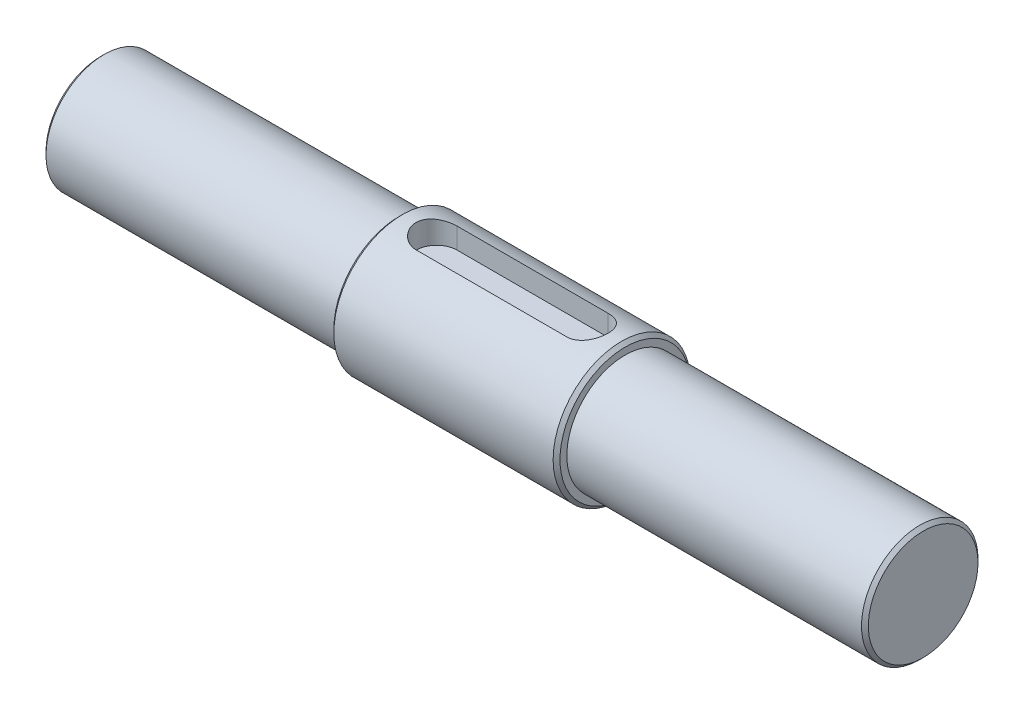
ISO-10303-21;
HEADER;
FILE_DESCRIPTION(('STEP AP214'),'2;1');
FILE_NAME('part.step','',(''),(''),'','','');
FILE_SCHEMA(('AUTOMOTIVE_DESIGN { 1 0 10303 214 1 1 1 1 }'));
ENDSEC;
DATA;
#1=APPLICATION_CONTEXT('core data for automotive mechanical design processes');
#2=APPLICATION_PROTOCOL_DEFINITION('international standard','automotive_design',2000,#1);
#3=PRODUCT_CONTEXT('',#1,'mechanical');
#4=PRODUCT('Part','Part','',(#3));
#5=PRODUCT_RELATED_PRODUCT_CATEGORY('part','',(#4));
#6=PRODUCT_DEFINITION_FORMATION('','',#4);
#7=PRODUCT_DEFINITION_CONTEXT('part definition',#1,'design');
#8=PRODUCT_DEFINITION('design','',#6,#7);
#9=PRODUCT_DEFINITION_SHAPE('','',#8);
#10=(LENGTH_UNIT() NAMED_UNIT(*) SI_UNIT(.MILLI.,.METRE.));
#11=(NAMED_UNIT(*) PLANE_ANGLE_UNIT() SI_UNIT($,.RADIAN.));
#12=(NAMED_UNIT(*) SI_UNIT($,.STERADIAN.) SOLID_ANGLE_UNIT());
#13=UNCERTAINTY_MEASURE_WITH_UNIT(LENGTH_MEASURE(1.E-05),#10,'distance_accuracy_value','');
#14=(GEOMETRIC_REPRESENTATION_CONTEXT(3) GLOBAL_UNCERTAINTY_ASSIGNED_CONTEXT((#13)) GLOBAL_UNIT_ASSIGNED_CONTEXT((#10,
#11,#12)) REPRESENTATION_CONTEXT('',''));
#15=CARTESIAN_POINT('',(0.,0.,0.));
#16=DIRECTION('',(0.,0.,1.));
#17=DIRECTION('',(1.,0.,0.));
#18=AXIS2_PLACEMENT_3D('',#15,#16,#17);
#19=CARTESIAN_POINT('',(78.5,0.,0.));
#20=DIRECTION('',(-1.,0.,0.));
#21=DIRECTION('',(0.,0.,1.));
#22=AXIS2_PLACEMENT_3D('',#19,#20,#21);
#23=CYLINDRICAL_SURFACE('',#22,10.);
#24=CARTESIAN_POINT('',(46.,0.,0.));
#25=DIRECTION('',(-1.,0.,0.));
#26=DIRECTION('',(0.,0.,1.));
#27=AXIS2_PLACEMENT_3D('',#24,#25,#26);
#28=CIRCLE('',#27,10.);
#29=CARTESIAN_POINT('',(46.,0.,10.));
#30=VERTEX_POINT('',#29);
#31=EDGE_CURVE('E177',#30,#30,#28,.F.);
#32=ORIENTED_EDGE('',*,*,#31,.T.);
#33=EDGE_LOOP('',(#32));
#34=FACE_BOUND('',#33,.T.);
#35=CARTESIAN_POINT('',(78.,0.,0.));
#36=DIRECTION('',(1.,0.,0.));
#37=DIRECTION('',(0.,0.,-1.));
#38=AXIS2_PLACEMENT_3D('',#35,#36,#37);
#39=CIRCLE('',#38,10.);
#40=CARTESIAN_POINT('',(78.,0.,-10.));
#41=VERTEX_POINT('',#40);
#42=EDGE_CURVE('E180',#41,#41,#39,.F.);
#43=ORIENTED_EDGE('',*,*,#42,.T.);
#44=EDGE_LOOP('',(#43));
#45=FACE_BOUND('',#44,.T.);
#46=CARTESIAN_POINT('',(73.,9.53939201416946,3.));
#47=CARTESIAN_POINT('',(73.0823355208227,9.53938054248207,3.00001027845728));
#48=CARTESIAN_POINT('',(73.1646644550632,9.54045772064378,2.99661062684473));
#49=CARTESIAN_POINT('',(73.3286939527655,9.54470412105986,2.98307142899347));
#50=CARTESIAN_POINT('',(73.4103946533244,9.54787287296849,2.97293339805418));
#51=CARTESIAN_POINT('',(73.5723849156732,9.55620668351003,2.94603140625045));
#52=CARTESIAN_POINT('',(73.652677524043,9.56136667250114,2.92928426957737));
#53=CARTESIAN_POINT('',(73.8114758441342,9.57351626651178,2.88932853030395));
#54=CARTESIAN_POINT('',(73.8899815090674,9.58050591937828,2.86611975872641));
#55=CARTESIAN_POINT('',(74.1219493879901,9.60391637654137,2.78708584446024));
#56=CARTESIAN_POINT('',(74.272068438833,9.62279007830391,2.72181852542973));
#57=CARTESIAN_POINT('',(74.559226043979,9.66493213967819,2.56815043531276));
#58=CARTESIAN_POINT('',(74.6962584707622,9.6882025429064,2.47973889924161));
#59=CARTESIAN_POINT('',(74.9577229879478,9.73733650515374,2.27929879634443));
#60=CARTESIAN_POINT('',(75.0816848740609,9.76325505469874,2.16666914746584));
#61=CARTESIAN_POINT('',(75.3092736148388,9.81429628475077,1.92227736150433));
#62=CARTESIAN_POINT('',(75.412897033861,9.8394188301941,1.79051199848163));
#63=CARTESIAN_POINT('',(75.5989268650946,9.88666477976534,1.50821997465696));
#64=CARTESIAN_POINT('',(75.6808501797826,9.90871541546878,1.35736167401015));
#65=CARTESIAN_POINT('',(75.8179770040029,9.94668940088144,1.04324233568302));
#66=CARTESIAN_POINT('',(75.873187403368,9.96261433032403,0.879984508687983));
#67=CARTESIAN_POINT('',(75.953759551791,9.98615279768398,0.5506494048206));
#68=CARTESIAN_POINT('',(75.9799297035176,9.99399098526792,0.3847862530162));
#69=CARTESIAN_POINT('',(76.004234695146,10.0012640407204,0.0508471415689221));
#70=CARTESIAN_POINT('',(76.0023748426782,10.0007004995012,-0.117228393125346));
#71=CARTESIAN_POINT('',(75.9712141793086,9.99139205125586,-0.445143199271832));
#72=CARTESIAN_POINT('',(75.9427893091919,9.98290831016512,-0.605074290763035));
#73=CARTESIAN_POINT('',(75.8607367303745,9.95903027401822,-0.91778010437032));
#74=CARTESIAN_POINT('',(75.8071077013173,9.94363561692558,-1.07055445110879));
#75=CARTESIAN_POINT('',(75.6755755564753,9.90730429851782,-1.36669563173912));
#76=CARTESIAN_POINT('',(75.5973967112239,9.88630511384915,-1.50993201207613));
#77=CARTESIAN_POINT('',(75.4192028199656,9.84099249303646,-1.78153105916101));
#78=CARTESIAN_POINT('',(75.3191828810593,9.81667831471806,-1.90989038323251));
#79=CARTESIAN_POINT('',(75.0956160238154,9.7662334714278,-2.15330901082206));
#80=CARTESIAN_POINT('',(74.9713122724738,9.74006890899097,-2.26766702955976));
#81=CARTESIAN_POINT('',(74.7050051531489,9.68968430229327,-2.47413538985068));
#82=CARTESIAN_POINT('',(74.5629966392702,9.66546482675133,-2.56623924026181));
#83=CARTESIAN_POINT('',(74.2634381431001,9.62154457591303,-2.72632814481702));
#84=CARTESIAN_POINT('',(74.1057456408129,9.60189192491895,-2.79406012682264));
#85=CARTESIAN_POINT('',(73.7805509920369,9.56991327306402,-2.90171772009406));
#86=CARTESIAN_POINT('',(73.6130642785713,9.55757606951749,-2.94168586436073));
#87=CARTESIAN_POINT('',(73.3700102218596,9.54628064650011,-2.9780240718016));
#88=CARTESIAN_POINT('',(73.2962185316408,9.54370312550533,-2.98626405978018));
#89=CARTESIAN_POINT('',(73.148297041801,9.54025857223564,-2.99724711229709));
#90=CARTESIAN_POINT('',(73.0741679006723,9.53938902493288,-2.99999825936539));
#91=CARTESIAN_POINT('',(73.,9.53939201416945,-3.00000000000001));
#92=B_SPLINE_CURVE_WITH_KNOTS('',3,(#46,#47,#48,#49,#50,#51,#52,#53,#54,#55,#56,#57,#58,#59,#60,
#61,#62,#63,#64,#65,#66,#67,#68,#69,#70,#71,#72,#73,#74,#75,#76,#77,#78,#79,#80,#81,#82,#83,#84,
#85,#86,#87,#88,#89,#90,#91),.UNSPECIFIED.,.F.,.F.,(4,2,2,2,2,2,2,2,2,2,2,2,2,2,2,2,2,2,2,2,2,2,
4),(0.,0.246918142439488,0.493780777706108,0.740019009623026,0.986263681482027,1.47813347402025,
1.97023245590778,2.47635119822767,2.98255536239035,3.49922810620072,4.01576751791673,
4.51753600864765,5.01920948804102,5.50490358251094,5.99062312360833,6.48200583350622,
6.97349873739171,7.48389234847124,7.99443465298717,8.51013494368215,9.02504345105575,
9.24774267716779,9.47011372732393),.UNSPECIFIED.);
#93=CARTESIAN_POINT('',(73.,9.53939201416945,3.00000000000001));
#94=VERTEX_POINT('',#93);
#95=CARTESIAN_POINT('',(73.,9.53939201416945,-3.00000000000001));
#96=VERTEX_POINT('',#95);
#97=EDGE_CURVE('E109',#94,#96,#92,.T.);
#98=ORIENTED_EDGE('',*,*,#97,.F.);
#99=DIRECTION('',(-1.,0.,0.));
#100=VECTOR('',#99,1.);
#101=CARTESIAN_POINT('',(61.,9.53939201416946,3.));
#102=LINE('',#101,#100);
#103=CARTESIAN_POINT('',(51.,9.53939201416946,3.));
#104=VERTEX_POINT('',#103);
#105=EDGE_CURVE('E62',#104,#94,#102,.F.);
#106=ORIENTED_EDGE('',*,*,#105,.F.);
#107=CARTESIAN_POINT('',(51.,9.53939201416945,-3.00000000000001));
#108=CARTESIAN_POINT('',(50.9176644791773,9.53938054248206,-3.00001027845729));
#109=CARTESIAN_POINT('',(50.8353355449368,9.54045772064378,-2.99661062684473));
#110=CARTESIAN_POINT('',(50.6713060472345,9.54470412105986,-2.98307142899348));
#111=CARTESIAN_POINT('',(50.5896053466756,9.54787287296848,-2.97293339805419));
#112=CARTESIAN_POINT('',(50.4276150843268,9.55620668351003,-2.94603140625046));
#113=CARTESIAN_POINT('',(50.347322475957,9.56136667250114,-2.92928426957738));
#114=CARTESIAN_POINT('',(50.1885241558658,9.57351626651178,-2.88932853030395));
#115=CARTESIAN_POINT('',(50.1100184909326,9.58050591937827,-2.86611975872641));
#116=CARTESIAN_POINT('',(49.8780506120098,9.60391637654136,-2.78708584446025));
#117=CARTESIAN_POINT('',(49.727931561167,9.62279007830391,-2.72181852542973));
#118=CARTESIAN_POINT('',(49.4407739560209,9.66493213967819,-2.56815043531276));
#119=CARTESIAN_POINT('',(49.3037415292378,9.68820254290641,-2.4797388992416));
#120=CARTESIAN_POINT('',(49.0422770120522,9.73733650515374,-2.27929879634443));
#121=CARTESIAN_POINT('',(48.9183151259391,9.76325505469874,-2.16666914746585));
#122=CARTESIAN_POINT('',(48.6907263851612,9.81429628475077,-1.92227736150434));
#123=CARTESIAN_POINT('',(48.587102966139,9.8394188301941,-1.79051199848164));
#124=CARTESIAN_POINT('',(48.4010731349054,9.88666477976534,-1.50821997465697));
#125=CARTESIAN_POINT('',(48.3191498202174,9.90871541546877,-1.35736167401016));
#126=CARTESIAN_POINT('',(48.1820229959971,9.94668940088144,-1.04324233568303));
#127=CARTESIAN_POINT('',(48.126812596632,9.96261433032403,-0.879984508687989));
#128=CARTESIAN_POINT('',(48.046240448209,9.98615279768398,-0.550649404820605));
#129=CARTESIAN_POINT('',(48.0200702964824,9.99399098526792,-0.384786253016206));
#130=CARTESIAN_POINT('',(47.9957653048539,10.0012640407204,-0.0508471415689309));
#131=CARTESIAN_POINT('',(47.9976251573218,10.0007004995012,0.117228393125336));
#132=CARTESIAN_POINT('',(48.0287858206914,9.99139205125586,0.445143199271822));
#133=CARTESIAN_POINT('',(48.0572106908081,9.98290831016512,0.605074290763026));
#134=CARTESIAN_POINT('',(48.1392632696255,9.95903027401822,0.917780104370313));
#135=CARTESIAN_POINT('',(48.1928922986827,9.94363561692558,1.07055445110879));
#136=CARTESIAN_POINT('',(48.3244244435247,9.90730429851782,1.36669563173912));
#137=CARTESIAN_POINT('',(48.4026032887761,9.88630511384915,1.50993201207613));
#138=CARTESIAN_POINT('',(48.5807971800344,9.84099249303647,1.781531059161));
#139=CARTESIAN_POINT('',(48.6808171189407,9.81667831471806,1.90989038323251));
#140=CARTESIAN_POINT('',(48.9043839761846,9.7662334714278,2.15330901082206));
#141=CARTESIAN_POINT('',(49.0286877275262,9.74006890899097,2.26766702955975));
#142=CARTESIAN_POINT('',(49.2949948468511,9.68968430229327,2.47413538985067));
#143=CARTESIAN_POINT('',(49.4370033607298,9.66546482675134,2.5662392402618));
#144=CARTESIAN_POINT('',(49.7365618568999,9.62154457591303,2.72632814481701));
#145=CARTESIAN_POINT('',(49.8942543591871,9.60189192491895,2.79406012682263));
#146=CARTESIAN_POINT('',(50.2194490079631,9.56991327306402,2.90171772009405));
#147=CARTESIAN_POINT('',(50.3869357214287,9.55757606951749,2.94168586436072));
#148=CARTESIAN_POINT('',(50.6299897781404,9.54628064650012,2.97802407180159));
#149=CARTESIAN_POINT('',(50.7037814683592,9.54370312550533,2.98626405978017));
#150=CARTESIAN_POINT('',(50.8517029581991,9.54025857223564,2.99724711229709));
#151=CARTESIAN_POINT('',(50.9258320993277,9.53938902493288,2.99999825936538));
#152=CARTESIAN_POINT('',(51.,9.53939201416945,3.));
#153=B_SPLINE_CURVE_WITH_KNOTS('',3,(#107,#108,#109,#110,#111,#112,#113,#114,#115,#116,#117,
#118,#119,#120,#121,#122,#123,#124,#125,#126,#127,#128,#129,#130,#131,#132,#133,#134,#135,#136,
#137,#138,#139,#140,#141,#142,#143,#144,#145,#146,#147,#148,#149,#150,#151,#152),.UNSPECIFIED.,
.F.,.F.,(4,2,2,2,2,2,2,2,2,2,2,2,2,2,2,2,2,2,2,2,2,2,4),(0.,0.246918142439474,0.493780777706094,
0.74001900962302,0.986263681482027,1.47813347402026,1.97023245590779,2.47635119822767,
2.98255536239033,3.49922810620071,4.01576751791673,4.51753600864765,5.01920948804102,
5.50490358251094,5.99062312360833,6.48200583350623,6.97349873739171,7.48389234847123,
7.99443465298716,8.51013494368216,9.02504345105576,9.24774267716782,9.47011372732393),.UNSPECIFIED.);
#154=CARTESIAN_POINT('',(51.,9.53939201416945,-3.00000000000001));
#155=VERTEX_POINT('',#154);
#156=EDGE_CURVE('E106',#155,#104,#153,.T.);
#157=ORIENTED_EDGE('',*,*,#156,.F.);
#158=DIRECTION('',(-1.,0.,0.));
#159=VECTOR('',#158,1.);
#160=CARTESIAN_POINT('',(61.,9.53939201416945,-3.00000000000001));
#161=LINE('',#160,#159);
#162=EDGE_CURVE('E117',#96,#155,#161,.T.);
#163=ORIENTED_EDGE('',*,*,#162,.F.);
#164=EDGE_LOOP('',(#98,#106,#157,#163));
#165=FACE_BOUND('',#164,.T.);
#166=ADVANCED_FACE('F41',(#34,#45,#165),#23,.T.);
#167=CARTESIAN_POINT('',(78.5,10.,0.));
#168=DIRECTION('',(1.,0.,0.));
#169=DIRECTION('',(0.,0.,-1.));
#170=AXIS2_PLACEMENT_3D('',#167,#168,#169);
#171=PLANE('',#170);
#172=CARTESIAN_POINT('',(78.5,0.,0.));
#173=DIRECTION('',(1.,0.,0.));
#174=DIRECTION('',(0.,0.,-1.));
#175=AXIS2_PLACEMENT_3D('',#172,#173,#174);
#176=CIRCLE('',#175,9.50000000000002);
#177=CARTESIAN_POINT('',(78.5,0.,-9.50000000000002));
#178=VERTEX_POINT('',#177);
#179=EDGE_CURVE('E11',#178,#178,#176,.T.);
#180=ORIENTED_EDGE('',*,*,#179,.T.);
#181=EDGE_LOOP('',(#180));
#182=FACE_BOUND('',#181,.T.);
#183=CARTESIAN_POINT('',(78.5,0.,0.));
#184=DIRECTION('',(1.,0.,0.));
#185=DIRECTION('',(0.,0.,-1.));
#186=AXIS2_PLACEMENT_3D('',#183,#184,#185);
#187=CIRCLE('',#186,8.5);
#188=CARTESIAN_POINT('',(78.5,0.,-8.5));
#189=VERTEX_POINT('',#188);
#190=EDGE_CURVE('E105',#189,#189,#187,.T.);
#191=ORIENTED_EDGE('',*,*,#190,.F.);
#192=EDGE_LOOP('',(#191));
#193=FACE_BOUND('',#192,.T.);
#194=ADVANCED_FACE('F149',(#182,#193),#171,.T.);
#195=CARTESIAN_POINT('',(45.5,0.,0.));
#196=DIRECTION('',(-1.,0.,0.));
#197=DIRECTION('',(0.,0.,1.));
#198=AXIS2_PLACEMENT_3D('',#195,#196,#197);
#199=PLANE('',#198);
#200=CARTESIAN_POINT('',(45.5,0.,0.));
#201=DIRECTION('',(-1.,0.,0.));
#202=DIRECTION('',(0.,0.,1.));
#203=AXIS2_PLACEMENT_3D('',#200,#201,#202);
#204=CIRCLE('',#203,9.49999999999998);
#205=CARTESIAN_POINT('',(45.5,0.,9.49999999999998));
#206=VERTEX_POINT('',#205);
#207=EDGE_CURVE('E185',#206,#206,#204,.T.);
#208=ORIENTED_EDGE('',*,*,#207,.T.);
#209=EDGE_LOOP('',(#208));
#210=FACE_BOUND('',#209,.T.);
#211=CARTESIAN_POINT('',(45.5,0.,0.));
#212=DIRECTION('',(-1.,0.,0.));
#213=DIRECTION('',(0.,0.,1.));
#214=AXIS2_PLACEMENT_3D('',#211,#212,#213);
#215=CIRCLE('',#214,8.5);
#216=CARTESIAN_POINT('',(45.5,0.,8.5));
#217=VERTEX_POINT('',#216);
#218=EDGE_CURVE('E194',#217,#217,#215,.T.);
#219=ORIENTED_EDGE('',*,*,#218,.F.);
#220=EDGE_LOOP('',(#219));
#221=FACE_BOUND('',#220,.T.);
#222=ADVANCED_FACE('F145',(#210,#221),#199,.T.);
#223=CARTESIAN_POINT('',(122.,0.,0.));
#224=DIRECTION('',(-1.,0.,0.));
#225=DIRECTION('',(0.,0.,1.));
#226=AXIS2_PLACEMENT_3D('',#223,#224,#225);
#227=CYLINDRICAL_SURFACE('',#226,8.5);
#228=CARTESIAN_POINT('',(121.5,0.,0.));
#229=DIRECTION('',(1.,0.,0.));
#230=DIRECTION('',(0.,0.,-1.));
#231=AXIS2_PLACEMENT_3D('',#228,#229,#230);
#232=CIRCLE('',#231,8.5);
#233=CARTESIAN_POINT('',(121.5,0.,-8.5));
#234=VERTEX_POINT('',#233);
#235=EDGE_CURVE('E49',#234,#234,#232,.F.);
#236=ORIENTED_EDGE('',*,*,#235,.T.);
#237=EDGE_LOOP('',(#236));
#238=FACE_BOUND('',#237,.T.);
#239=ORIENTED_EDGE('',*,*,#190,.T.);
#240=EDGE_LOOP('',(#239));
#241=FACE_BOUND('',#240,.T.);
#242=ADVANCED_FACE('F141',(#238,#241),#227,.T.);
#243=CARTESIAN_POINT('',(122.,0.,0.));
#244=DIRECTION('',(1.,0.,0.));
#245=DIRECTION('',(0.,0.,-1.));
#246=AXIS2_PLACEMENT_3D('',#243,#244,#245);
#247=PLANE('',#246);
#248=CARTESIAN_POINT('',(122.,0.,0.));
#249=DIRECTION('',(1.,0.,0.));
#250=DIRECTION('',(0.,0.,-1.));
#251=AXIS2_PLACEMENT_3D('',#248,#249,#250);
#252=CIRCLE('',#251,7.99999999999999);
#253=CARTESIAN_POINT('',(122.,0.,-7.99999999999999));
#254=VERTEX_POINT('',#253);
#255=EDGE_CURVE('E176',#254,#254,#252,.T.);
#256=ORIENTED_EDGE('',*,*,#255,.T.);
#257=EDGE_LOOP('',(#256));
#258=FACE_BOUND('',#257,.T.);
#259=ADVANCED_FACE('F137',(#258),#247,.T.);
#260=CARTESIAN_POINT('',(1.99999999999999,0.,0.));
#261=DIRECTION('',(1.,0.,0.));
#262=DIRECTION('',(0.,0.,-1.));
#263=AXIS2_PLACEMENT_3D('',#260,#261,#262);
#264=CYLINDRICAL_SURFACE('',#263,8.5);
#265=CARTESIAN_POINT('',(2.50000000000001,0.,0.));
#266=DIRECTION('',(-1.,0.,0.));
#267=DIRECTION('',(0.,0.,1.));
#268=AXIS2_PLACEMENT_3D('',#265,#266,#267);
#269=CIRCLE('',#268,8.5);
#270=CARTESIAN_POINT('',(2.50000000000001,0.,8.5));
#271=VERTEX_POINT('',#270);
#272=EDGE_CURVE('E188',#271,#271,#269,.F.);
#273=ORIENTED_EDGE('',*,*,#272,.T.);
#274=EDGE_LOOP('',(#273));
#275=FACE_BOUND('',#274,.T.);
#276=ORIENTED_EDGE('',*,*,#218,.T.);
#277=EDGE_LOOP('',(#276));
#278=FACE_BOUND('',#277,.T.);
#279=ADVANCED_FACE('F133',(#275,#278),#264,.T.);
#280=CARTESIAN_POINT('',(1.99999999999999,0.,0.));
#281=DIRECTION('',(-1.,0.,0.));
#282=DIRECTION('',(0.,0.,1.));
#283=AXIS2_PLACEMENT_3D('',#280,#281,#282);
#284=PLANE('',#283);
#285=CARTESIAN_POINT('',(1.99999999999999,0.,0.));
#286=DIRECTION('',(-1.,0.,0.));
#287=DIRECTION('',(0.,0.,1.));
#288=AXIS2_PLACEMENT_3D('',#285,#286,#287);
#289=CIRCLE('',#288,7.99999999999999);
#290=CARTESIAN_POINT('',(1.99999999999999,0.,7.99999999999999));
#291=VERTEX_POINT('',#290);
#292=EDGE_CURVE('E191',#291,#291,#289,.T.);
#293=ORIENTED_EDGE('',*,*,#292,.T.);
#294=EDGE_LOOP('',(#293));
#295=FACE_BOUND('',#294,.T.);
#296=ADVANCED_FACE('F129',(#295),#284,.T.);
#297=CARTESIAN_POINT('',(73.,10.001,0.));
#298=DIRECTION('',(0.,-1.,0.));
#299=DIRECTION('',(0.,0.,-1.));
#300=AXIS2_PLACEMENT_3D('',#297,#298,#299);
#301=CYLINDRICAL_SURFACE('',#300,3.00000000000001);
#302=ORIENTED_EDGE('',*,*,#97,.T.);
#303=DIRECTION('',(0.,-1.,0.));
#304=VECTOR('',#303,1.);
#305=CARTESIAN_POINT('',(73.,10.001,-3.00000000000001));
#306=LINE('',#305,#304);
#307=CARTESIAN_POINT('',(73.,6.50000000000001,-3.00000000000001));
#308=VERTEX_POINT('',#307);
#309=EDGE_CURVE('E85',#96,#308,#306,.T.);
#310=ORIENTED_EDGE('',*,*,#309,.T.);
#311=CARTESIAN_POINT('',(73.,6.50000000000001,0.));
#312=DIRECTION('',(0.,-1.,0.));
#313=DIRECTION('',(0.,0.,-1.));
#314=AXIS2_PLACEMENT_3D('',#311,#312,#313);
#315=CIRCLE('',#314,3.00000000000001);
#316=CARTESIAN_POINT('',(73.,6.50000000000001,3.00000000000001));
#317=VERTEX_POINT('',#316);
#318=EDGE_CURVE('E92',#308,#317,#315,.T.);
#319=ORIENTED_EDGE('',*,*,#318,.T.);
#320=DIRECTION('',(0.,-1.,0.));
#321=VECTOR('',#320,1.);
#322=CARTESIAN_POINT('',(73.,10.001,3.));
#323=LINE('',#322,#321);
#324=EDGE_CURVE('E77',#94,#317,#323,.T.);
#325=ORIENTED_EDGE('',*,*,#324,.F.);
#326=EDGE_LOOP('',(#302,#310,#319,#325));
#327=FACE_BOUND('',#326,.T.);
#328=ADVANCED_FACE('F97',(#327),#301,.F.);
#329=CARTESIAN_POINT('',(51.,10.001,-3.00000000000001));
#330=DIRECTION('',(0.,0.,-1.));
#331=DIRECTION('',(0.,1.,0.));
#332=AXIS2_PLACEMENT_3D('',#329,#330,#331);
#333=PLANE('',#332);
#334=ORIENTED_EDGE('',*,*,#162,.T.);
#335=DIRECTION('',(0.,-1.,0.));
#336=VECTOR('',#335,1.);
#337=CARTESIAN_POINT('',(51.,10.001,-3.00000000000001));
#338=LINE('',#337,#336);
#339=CARTESIAN_POINT('',(51.,6.50000000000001,-3.00000000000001));
#340=VERTEX_POINT('',#339);
#341=EDGE_CURVE('E100',#155,#340,#338,.T.);
#342=ORIENTED_EDGE('',*,*,#341,.T.);
#343=DIRECTION('',(1.,0.,0.));
#344=VECTOR('',#343,1.);
#345=CARTESIAN_POINT('',(51.,6.50000000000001,-3.00000000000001));
#346=LINE('',#345,#344);
#347=EDGE_CURVE('E118',#340,#308,#346,.T.);
#348=ORIENTED_EDGE('',*,*,#347,.T.);
#349=ORIENTED_EDGE('',*,*,#309,.F.);
#350=EDGE_LOOP('',(#334,#342,#348,#349));
#351=FACE_BOUND('',#350,.T.);
#352=ADVANCED_FACE('F215',(#351),#333,.F.);
#353=CARTESIAN_POINT('',(51.,10.001,0.));
#354=DIRECTION('',(0.,-1.,0.));
#355=DIRECTION('',(0.,0.,-1.));
#356=AXIS2_PLACEMENT_3D('',#353,#354,#355);
#357=CYLINDRICAL_SURFACE('',#356,3.00000000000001);
#358=ORIENTED_EDGE('',*,*,#156,.T.);
#359=DIRECTION('',(0.,-1.,0.));
#360=VECTOR('',#359,1.);
#361=CARTESIAN_POINT('',(51.,10.001,3.));
#362=LINE('',#361,#360);
#363=CARTESIAN_POINT('',(51.,6.50000000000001,3.));
#364=VERTEX_POINT('',#363);
#365=EDGE_CURVE('E56',#104,#364,#362,.T.);
#366=ORIENTED_EDGE('',*,*,#365,.T.);
#367=CARTESIAN_POINT('',(51.,6.50000000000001,0.));
#368=DIRECTION('',(0.,-1.,0.));
#369=DIRECTION('',(0.,0.,-1.));
#370=AXIS2_PLACEMENT_3D('',#367,#368,#369);
#371=CIRCLE('',#370,3.00000000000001);
#372=EDGE_CURVE('E95',#364,#340,#371,.T.);
#373=ORIENTED_EDGE('',*,*,#372,.T.);
#374=ORIENTED_EDGE('',*,*,#341,.F.);
#375=EDGE_LOOP('',(#358,#366,#373,#374));
#376=FACE_BOUND('',#375,.T.);
#377=ADVANCED_FACE('F220',(#376),#357,.F.);
#378=CARTESIAN_POINT('',(73.,10.001,3.));
#379=DIRECTION('',(0.,0.,1.));
#380=DIRECTION('',(0.,-1.,0.));
#381=AXIS2_PLACEMENT_3D('',#378,#379,#380);
#382=PLANE('',#381);
#383=ORIENTED_EDGE('',*,*,#105,.T.);
#384=ORIENTED_EDGE('',*,*,#324,.T.);
#385=DIRECTION('',(-1.,0.,0.));
#386=VECTOR('',#385,1.);
#387=CARTESIAN_POINT('',(73.,6.50000000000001,3.00000000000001));
#388=LINE('',#387,#386);
#389=EDGE_CURVE('E80',#317,#364,#388,.T.);
#390=ORIENTED_EDGE('',*,*,#389,.T.);
#391=ORIENTED_EDGE('',*,*,#365,.F.);
#392=EDGE_LOOP('',(#383,#384,#390,#391));
#393=FACE_BOUND('',#392,.T.);
#394=ADVANCED_FACE('F79',(#393),#382,.F.);
#395=CARTESIAN_POINT('',(73.,6.50000000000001,0.));
#396=DIRECTION('',(0.,-1.,0.));
#397=DIRECTION('',(0.,0.,-1.));
#398=AXIS2_PLACEMENT_3D('',#395,#396,#397);
#399=PLANE('',#398);
#400=ORIENTED_EDGE('',*,*,#318,.F.);
#401=ORIENTED_EDGE('',*,*,#347,.F.);
#402=ORIENTED_EDGE('',*,*,#372,.F.);
#403=ORIENTED_EDGE('',*,*,#389,.F.);
#404=EDGE_LOOP('',(#400,#401,#402,#403));
#405=FACE_BOUND('',#404,.T.);
#406=ADVANCED_FACE('F90',(#405),#399,.F.);
#407=CARTESIAN_POINT('',(1.99999999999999,0.,0.));
#408=DIRECTION('',(1.,0.,0.));
#409=DIRECTION('',(0.,0.,-1.));
#410=AXIS2_PLACEMENT_3D('',#407,#408,#409);
#411=CONICAL_SURFACE('',#410,7.99999999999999,0.785398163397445);
#412=ORIENTED_EDGE('',*,*,#272,.F.);
#413=EDGE_LOOP('',(#412));
#414=FACE_BOUND('',#413,.T.);
#415=ORIENTED_EDGE('',*,*,#292,.F.);
#416=EDGE_LOOP('',(#415));
#417=FACE_BOUND('',#416,.T.);
#418=ADVANCED_FACE('F157',(#414,#417),#411,.T.);
#419=CARTESIAN_POINT('',(45.5,0.,0.));
#420=DIRECTION('',(1.,0.,0.));
#421=DIRECTION('',(0.,0.,-1.));
#422=AXIS2_PLACEMENT_3D('',#419,#420,#421);
#423=CONICAL_SURFACE('',#422,9.49999999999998,0.785398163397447);
#424=ORIENTED_EDGE('',*,*,#31,.F.);
#425=EDGE_LOOP('',(#424));
#426=FACE_BOUND('',#425,.T.);
#427=ORIENTED_EDGE('',*,*,#207,.F.);
#428=EDGE_LOOP('',(#427));
#429=FACE_BOUND('',#428,.T.);
#430=ADVANCED_FACE('F160',(#426,#429),#423,.T.);
#431=CARTESIAN_POINT('',(122.,0.,0.));
#432=DIRECTION('',(-1.,0.,0.));
#433=DIRECTION('',(0.,0.,1.));
#434=AXIS2_PLACEMENT_3D('',#431,#432,#433);
#435=CONICAL_SURFACE('',#434,7.99999999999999,0.785398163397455);
#436=ORIENTED_EDGE('',*,*,#235,.F.);
#437=EDGE_LOOP('',(#436));
#438=FACE_BOUND('',#437,.T.);
#439=ORIENTED_EDGE('',*,*,#255,.F.);
#440=EDGE_LOOP('',(#439));
#441=FACE_BOUND('',#440,.T.);
#442=ADVANCED_FACE('F163',(#438,#441),#435,.T.);
#443=CARTESIAN_POINT('',(78.,0.,0.));
#444=DIRECTION('',(-1.,0.,0.));
#445=DIRECTION('',(0.,0.,1.));
#446=AXIS2_PLACEMENT_3D('',#443,#444,#445);
#447=CONICAL_SURFACE('',#446,10.,0.785398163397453);
#448=ORIENTED_EDGE('',*,*,#179,.F.);
#449=EDGE_LOOP('',(#448));
#450=FACE_BOUND('',#449,.T.);
#451=ORIENTED_EDGE('',*,*,#42,.F.);
#452=EDGE_LOOP('',(#451));
#453=FACE_BOUND('',#452,.T.);
#454=ADVANCED_FACE('F43',(#450,#453),#447,.T.);
#455=CLOSED_SHELL('',(#166,#194,#222,#242,#259,#279,#296,#328,#352,#377,#394,#406,#418,#430,
#442,#454));
#456=MANIFOLD_SOLID_BREP('B2',#455);
#457=ADVANCED_BREP_SHAPE_REPRESENTATION('',(#18,#456),#14);
#458=SHAPE_DEFINITION_REPRESENTATION(#9,#457);
ENDSEC;
END-ISO-10303-21;
